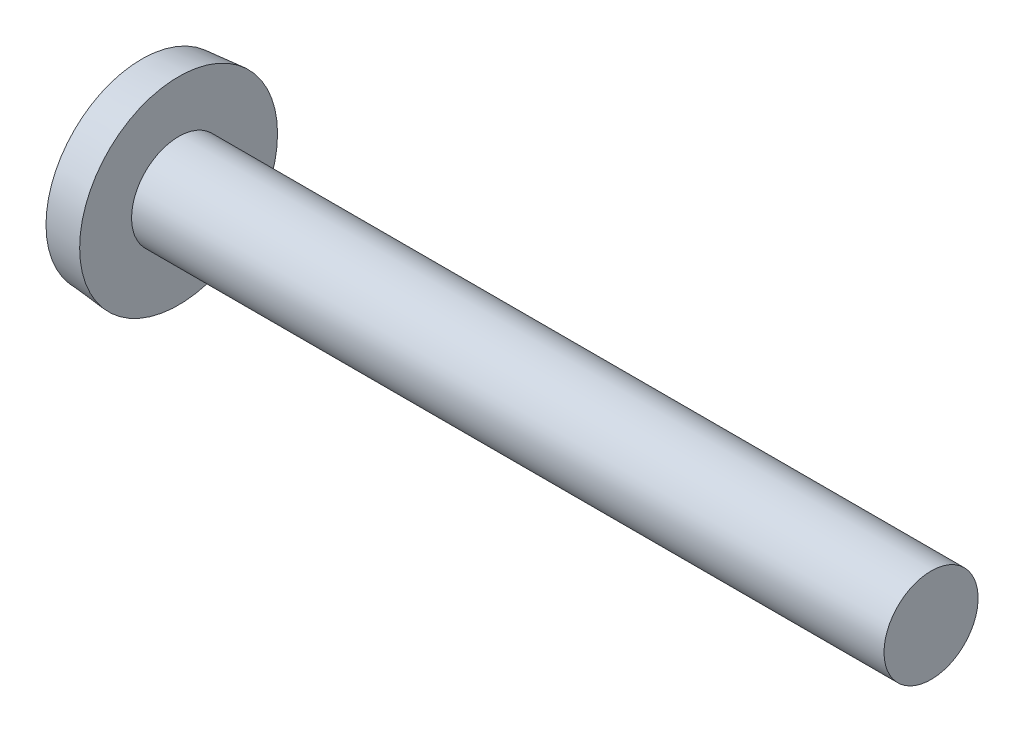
ISO-10303-21;
HEADER;
FILE_DESCRIPTION(('STEP AP214'),'2;1');
FILE_NAME('part.step','',(''),(''),'','','');
FILE_SCHEMA(('AUTOMOTIVE_DESIGN { 1 0 10303 214 1 1 1 1 }'));
ENDSEC;
DATA;
#1=APPLICATION_CONTEXT('core data for automotive mechanical design processes');
#2=APPLICATION_PROTOCOL_DEFINITION('international standard','automotive_design',2000,#1);
#3=PRODUCT_CONTEXT('',#1,'mechanical');
#4=PRODUCT('Part','Part','',(#3));
#5=PRODUCT_RELATED_PRODUCT_CATEGORY('part','',(#4));
#6=PRODUCT_DEFINITION_FORMATION('','',#4);
#7=PRODUCT_DEFINITION_CONTEXT('part definition',#1,'design');
#8=PRODUCT_DEFINITION('design','',#6,#7);
#9=PRODUCT_DEFINITION_SHAPE('','',#8);
#10=(LENGTH_UNIT() NAMED_UNIT(*) SI_UNIT(.MILLI.,.METRE.));
#11=(NAMED_UNIT(*) PLANE_ANGLE_UNIT() SI_UNIT($,.RADIAN.));
#12=(NAMED_UNIT(*) SI_UNIT($,.STERADIAN.) SOLID_ANGLE_UNIT());
#13=UNCERTAINTY_MEASURE_WITH_UNIT(LENGTH_MEASURE(1.E-05),#10,'distance_accuracy_value','');
#14=(GEOMETRIC_REPRESENTATION_CONTEXT(3) GLOBAL_UNCERTAINTY_ASSIGNED_CONTEXT((#13)) GLOBAL_UNIT_ASSIGNED_CONTEXT((#10,
#11,#12)) REPRESENTATION_CONTEXT('',''));
#15=CARTESIAN_POINT('',(0.,0.,0.));
#16=DIRECTION('',(0.,0.,1.));
#17=DIRECTION('',(1.,0.,0.));
#18=AXIS2_PLACEMENT_3D('',#15,#16,#17);
#19=CARTESIAN_POINT('',(7.45540865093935,0.,0.));
#20=DIRECTION('',(-1.,0.,0.));
#21=DIRECTION('',(0.,1.,0.));
#22=AXIS2_PLACEMENT_3D('',#19,#20,#21);
#23=SPHERICAL_SURFACE('',#22,7.45540865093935);
#24=CARTESIAN_POINT('',(0.7366,0.,0.));
#25=DIRECTION('',(-1.,0.,0.));
#26=DIRECTION('',(0.,0.,1.));
#27=AXIS2_PLACEMENT_3D('',#24,#25,#26);
#28=CIRCLE('',#27,3.23121160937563);
#29=CARTESIAN_POINT('',(0.7366,0.,3.23121160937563));
#30=VERTEX_POINT('',#29);
#31=EDGE_CURVE('E150',#30,#30,#28,.T.);
#32=ORIENTED_EDGE('',*,*,#31,.T.);
#33=EDGE_LOOP('',(#32));
#34=FACE_BOUND('',#33,.T.);
#35=CARTESIAN_POINT('',(7.43469231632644,0.,-0.225577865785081));
#36=DIRECTION('',(-0.091451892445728,0.,-0.99580949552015));
#37=DIRECTION('',(-0.99580949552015,0.,0.091451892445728));
#38=AXIS2_PLACEMENT_3D('',#35,#36,#37);
#39=CIRCLE('',#38,7.45196642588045);
#40=CARTESIAN_POINT('',(0.277056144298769,1.96671302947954,0.431756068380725));
#41=VERTEX_POINT('',#40);
#42=CARTESIAN_POINT('',(0.0277773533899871,0.454649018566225,0.454649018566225));
#43=VERTEX_POINT('',#42);
#44=EDGE_CURVE('E121',#41,#43,#39,.F.);
#45=ORIENTED_EDGE('',*,*,#44,.T.);
#46=CARTESIAN_POINT('',(7.43469231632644,-0.225577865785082,0.));
#47=DIRECTION('',(-0.0914518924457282,-0.99580949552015,0.));
#48=DIRECTION('',(0.99580949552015,-0.0914518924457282,0.));
#49=AXIS2_PLACEMENT_3D('',#46,#47,#48);
#50=CIRCLE('',#49,7.45196642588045);
#51=CARTESIAN_POINT('',(0.277056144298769,0.431756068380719,1.96671302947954));
#52=VERTEX_POINT('',#51);
#53=EDGE_CURVE('E102',#43,#52,#50,.F.);
#54=ORIENTED_EDGE('',*,*,#53,.T.);
#55=CARTESIAN_POINT('',(5.67084446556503,0.,-2.27126350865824));
#56=DIRECTION('',(0.617821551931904,0.,0.786318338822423));
#57=DIRECTION('',(0.786318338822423,0.,-0.617821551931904));
#58=AXIS2_PLACEMENT_3D('',#55,#56,#57);
#59=CIRCLE('',#58,6.87312235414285);
#60=CARTESIAN_POINT('',(0.277056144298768,-0.431756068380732,1.96671302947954));
#61=VERTEX_POINT('',#60);
#62=EDGE_CURVE('E113',#61,#52,#59,.F.);
#63=ORIENTED_EDGE('',*,*,#62,.F.);
#64=CARTESIAN_POINT('',(7.43469231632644,0.225577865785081,0.));
#65=DIRECTION('',(-0.091451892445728,0.99580949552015,0.));
#66=DIRECTION('',(-0.99580949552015,-0.091451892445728,0.));
#67=AXIS2_PLACEMENT_3D('',#64,#65,#66);
#68=CIRCLE('',#67,7.45196642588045);
#69=CARTESIAN_POINT('',(0.0277773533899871,-0.454649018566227,0.454649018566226));
#70=VERTEX_POINT('',#69);
#71=EDGE_CURVE('E188',#61,#70,#68,.F.);
#72=ORIENTED_EDGE('',*,*,#71,.T.);
#73=CARTESIAN_POINT('',(0.277056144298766,-1.96671302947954,0.431756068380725));
#74=VERTEX_POINT('',#73);
#75=EDGE_CURVE('E158',#70,#74,#39,.F.);
#76=ORIENTED_EDGE('',*,*,#75,.T.);
#77=CARTESIAN_POINT('',(5.67084446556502,2.27126350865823,0.));
#78=DIRECTION('',(0.617821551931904,-0.786318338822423,0.));
#79=DIRECTION('',(0.786318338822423,0.617821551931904,0.));
#80=AXIS2_PLACEMENT_3D('',#77,#78,#79);
#81=CIRCLE('',#80,6.87312235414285);
#82=CARTESIAN_POINT('',(0.277056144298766,-1.96671302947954,-0.431756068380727));
#83=VERTEX_POINT('',#82);
#84=EDGE_CURVE('E156',#83,#74,#81,.F.);
#85=ORIENTED_EDGE('',*,*,#84,.F.);
#86=CARTESIAN_POINT('',(7.43469231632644,0.,0.225577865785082));
#87=DIRECTION('',(-0.0914518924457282,0.,0.99580949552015));
#88=DIRECTION('',(0.99580949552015,0.,0.0914518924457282));
#89=AXIS2_PLACEMENT_3D('',#86,#87,#88);
#90=CIRCLE('',#89,7.45196642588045);
#91=CARTESIAN_POINT('',(0.0277773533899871,-0.454649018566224,-0.454649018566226));
#92=VERTEX_POINT('',#91);
#93=EDGE_CURVE('E160',#83,#92,#90,.F.);
#94=ORIENTED_EDGE('',*,*,#93,.T.);
#95=CARTESIAN_POINT('',(0.277056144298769,-0.431756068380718,-1.96671302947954));
#96=VERTEX_POINT('',#95);
#97=EDGE_CURVE('E186',#92,#96,#68,.F.);
#98=ORIENTED_EDGE('',*,*,#97,.T.);
#99=CARTESIAN_POINT('',(5.67084446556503,0.,2.27126350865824));
#100=DIRECTION('',(0.617821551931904,0.,-0.786318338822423));
#101=DIRECTION('',(-0.786318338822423,0.,-0.617821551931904));
#102=AXIS2_PLACEMENT_3D('',#99,#100,#101);
#103=CIRCLE('',#102,6.87312235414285);
#104=CARTESIAN_POINT('',(0.277056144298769,0.431756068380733,-1.96671302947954));
#105=VERTEX_POINT('',#104);
#106=EDGE_CURVE('E114',#105,#96,#103,.F.);
#107=ORIENTED_EDGE('',*,*,#106,.F.);
#108=CARTESIAN_POINT('',(0.0277773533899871,0.454649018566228,-0.454649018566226));
#109=VERTEX_POINT('',#108);
#110=EDGE_CURVE('E137',#105,#109,#50,.F.);
#111=ORIENTED_EDGE('',*,*,#110,.T.);
#112=CARTESIAN_POINT('',(0.277056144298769,1.96671302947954,-0.431756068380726));
#113=VERTEX_POINT('',#112);
#114=EDGE_CURVE('E53',#109,#113,#90,.F.);
#115=ORIENTED_EDGE('',*,*,#114,.T.);
#116=CARTESIAN_POINT('',(5.67084446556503,-2.27126350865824,0.));
#117=DIRECTION('',(0.617821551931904,0.786318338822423,0.));
#118=DIRECTION('',(-0.786318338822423,0.617821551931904,0.));
#119=AXIS2_PLACEMENT_3D('',#116,#117,#118);
#120=CIRCLE('',#119,6.87312235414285);
#121=EDGE_CURVE('E38',#41,#113,#120,.F.);
#122=ORIENTED_EDGE('',*,*,#121,.F.);
#123=EDGE_LOOP('',(#45,#54,#63,#72,#76,#85,#94,#98,#107,#111,#115,#122));
#124=FACE_BOUND('',#123,.T.);
#125=ADVANCED_FACE('F30',(#34,#124),#23,.T.);
#126=CARTESIAN_POINT('',(2.78014545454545,0.,-0.20188051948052));
#127=DIRECTION('',(-0.0914518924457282,0.,0.99580949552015));
#128=DIRECTION('',(0.99580949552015,0.,0.0914518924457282));
#129=AXIS2_PLACEMENT_3D('',#126,#127,#128);
#130=PLANE('',#129);
#131=ORIENTED_EDGE('',*,*,#114,.F.);
#132=DIRECTION('',(0.991671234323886,-0.0910718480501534,0.091071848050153));
#133=VECTOR('',#132,1.);
#134=CARTESIAN_POINT('',(2.79837795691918,0.200206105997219,-0.200206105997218));
#135=LINE('',#134,#133);
#136=CARTESIAN_POINT('',(2.4892,0.228600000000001,-0.228599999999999));
#137=VERTEX_POINT('',#136);
#138=EDGE_CURVE('E139',#109,#137,#135,.T.);
#139=ORIENTED_EDGE('',*,*,#138,.T.);
#140=DIRECTION('',(0.78427611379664,-0.616216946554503,0.0720253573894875));
#141=VECTOR('',#140,1.);
#142=CARTESIAN_POINT('',(0.,2.1844,-0.4572));
#143=LINE('',#142,#141);
#144=EDGE_CURVE('E123',#113,#137,#143,.T.);
#145=ORIENTED_EDGE('',*,*,#144,.F.);
#146=EDGE_LOOP('',(#131,#139,#145));
#147=FACE_BOUND('',#146,.T.);
#148=ADVANCED_FACE('F164',(#147),#130,.T.);
#149=DIRECTION('',(0.784276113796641,0.616216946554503,0.0720253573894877));
#150=VECTOR('',#149,1.);
#151=CARTESIAN_POINT('',(0.,-2.1844,-0.457200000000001));
#152=LINE('',#151,#150);
#153=CARTESIAN_POINT('',(2.4892,-0.2286,-0.2286));
#154=VERTEX_POINT('',#153);
#155=EDGE_CURVE('E45',#83,#154,#152,.T.);
#156=ORIENTED_EDGE('',*,*,#155,.T.);
#157=DIRECTION('',(-0.991671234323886,-0.0910718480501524,-0.091071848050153));
#158=VECTOR('',#157,1.);
#159=CARTESIAN_POINT('',(2.79837795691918,-0.200206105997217,-0.200206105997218));
#160=LINE('',#159,#158);
#161=EDGE_CURVE('E184',#154,#92,#160,.T.);
#162=ORIENTED_EDGE('',*,*,#161,.T.);
#163=ORIENTED_EDGE('',*,*,#93,.F.);
#164=EDGE_LOOP('',(#156,#162,#163));
#165=FACE_BOUND('',#164,.T.);
#166=ADVANCED_FACE('F190',(#165),#130,.T.);
#167=CARTESIAN_POINT('',(2.78014545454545,0.,0.201880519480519));
#168=DIRECTION('',(-0.091451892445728,0.,-0.99580949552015));
#169=DIRECTION('',(-0.99580949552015,0.,0.091451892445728));
#170=AXIS2_PLACEMENT_3D('',#167,#168,#169);
#171=PLANE('',#170);
#172=DIRECTION('',(0.78427611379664,-0.616216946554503,-0.0720253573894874));
#173=VECTOR('',#172,1.);
#174=CARTESIAN_POINT('',(0.,2.1844,0.4572));
#175=LINE('',#174,#173);
#176=CARTESIAN_POINT('',(2.4892,0.228599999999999,0.228600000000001));
#177=VERTEX_POINT('',#176);
#178=EDGE_CURVE('E118',#41,#177,#175,.T.);
#179=ORIENTED_EDGE('',*,*,#178,.T.);
#180=DIRECTION('',(-0.991671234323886,0.0910718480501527,0.0910718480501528));
#181=VECTOR('',#180,1.);
#182=CARTESIAN_POINT('',(2.79837795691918,0.200206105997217,0.200206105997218));
#183=LINE('',#182,#181);
#184=EDGE_CURVE('E11',#177,#43,#183,.T.);
#185=ORIENTED_EDGE('',*,*,#184,.T.);
#186=ORIENTED_EDGE('',*,*,#44,.F.);
#187=EDGE_LOOP('',(#179,#185,#186));
#188=FACE_BOUND('',#187,.T.);
#189=ADVANCED_FACE('F120',(#188),#171,.T.);
#190=ORIENTED_EDGE('',*,*,#75,.F.);
#191=DIRECTION('',(0.991671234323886,0.0910718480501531,-0.0910718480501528));
#192=VECTOR('',#191,1.);
#193=CARTESIAN_POINT('',(2.79837795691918,-0.200206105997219,0.200206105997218));
#194=LINE('',#193,#192);
#195=CARTESIAN_POINT('',(2.4892,-0.2286,0.2286));
#196=VERTEX_POINT('',#195);
#197=EDGE_CURVE('E198',#70,#196,#194,.T.);
#198=ORIENTED_EDGE('',*,*,#197,.T.);
#199=DIRECTION('',(0.784276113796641,0.616216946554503,-0.0720253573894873));
#200=VECTOR('',#199,1.);
#201=CARTESIAN_POINT('',(0.,-2.1844,0.4572));
#202=LINE('',#201,#200);
#203=EDGE_CURVE('E169',#74,#196,#202,.T.);
#204=ORIENTED_EDGE('',*,*,#203,.F.);
#205=EDGE_LOOP('',(#190,#198,#204));
#206=FACE_BOUND('',#205,.T.);
#207=ADVANCED_FACE('F197',(#206),#171,.T.);
#208=CARTESIAN_POINT('',(-25.4,0.,0.));
#209=DIRECTION('',(-1.,0.,0.));
#210=DIRECTION('',(0.,0.,1.));
#211=AXIS2_PLACEMENT_3D('',#208,#209,#210);
#212=CYLINDRICAL_SURFACE('',#211,1.5875);
#213=CARTESIAN_POINT('',(27.3812,0.,0.));
#214=DIRECTION('',(-1.,0.,0.));
#215=DIRECTION('',(0.,0.,1.));
#216=AXIS2_PLACEMENT_3D('',#213,#214,#215);
#217=CIRCLE('',#216,1.5875);
#218=CARTESIAN_POINT('',(27.3812,0.,1.5875));
#219=VERTEX_POINT('',#218);
#220=EDGE_CURVE('E153',#219,#219,#217,.T.);
#221=ORIENTED_EDGE('',*,*,#220,.T.);
#222=EDGE_LOOP('',(#221));
#223=FACE_BOUND('',#222,.T.);
#224=CARTESIAN_POINT('',(1.9812,0.,0.));
#225=DIRECTION('',(-1.,0.,0.));
#226=DIRECTION('',(0.,0.,1.));
#227=AXIS2_PLACEMENT_3D('',#224,#225,#226);
#228=CIRCLE('',#227,1.5875);
#229=CARTESIAN_POINT('',(1.9812,0.,1.5875));
#230=VERTEX_POINT('',#229);
#231=EDGE_CURVE('E144',#230,#230,#228,.T.);
#232=ORIENTED_EDGE('',*,*,#231,.F.);
#233=EDGE_LOOP('',(#232));
#234=FACE_BOUND('',#233,.T.);
#235=ADVANCED_FACE('F32',(#223,#234),#212,.T.);
#236=CARTESIAN_POINT('',(27.3812,1.5875,0.));
#237=DIRECTION('',(1.,0.,0.));
#238=DIRECTION('',(0.,0.,-1.));
#239=AXIS2_PLACEMENT_3D('',#236,#237,#238);
#240=PLANE('',#239);
#241=ORIENTED_EDGE('',*,*,#220,.F.);
#242=EDGE_LOOP('',(#241));
#243=FACE_BOUND('',#242,.T.);
#244=ADVANCED_FACE('F229',(#243),#240,.T.);
#245=CARTESIAN_POINT('',(1.9812,0.,0.));
#246=DIRECTION('',(1.,0.,0.));
#247=DIRECTION('',(0.,0.,-1.));
#248=AXIS2_PLACEMENT_3D('',#245,#246,#247);
#249=CONICAL_SURFACE('',#248,3.3401,0.0872664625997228);
#250=ORIENTED_EDGE('',*,*,#31,.F.);
#251=EDGE_LOOP('',(#250));
#252=FACE_BOUND('',#251,.T.);
#253=CARTESIAN_POINT('',(1.9812,0.,0.));
#254=DIRECTION('',(-1.,0.,0.));
#255=DIRECTION('',(0.,0.,1.));
#256=AXIS2_PLACEMENT_3D('',#253,#254,#255);
#257=CIRCLE('',#256,3.3401);
#258=CARTESIAN_POINT('',(1.9812,0.,3.3401));
#259=VERTEX_POINT('',#258);
#260=EDGE_CURVE('E147',#259,#259,#257,.T.);
#261=ORIENTED_EDGE('',*,*,#260,.T.);
#262=EDGE_LOOP('',(#261));
#263=FACE_BOUND('',#262,.T.);
#264=ADVANCED_FACE('F227',(#252,#263),#249,.T.);
#265=CARTESIAN_POINT('',(1.9812,1.5875,0.));
#266=DIRECTION('',(-1.,0.,0.));
#267=DIRECTION('',(0.,0.,1.));
#268=AXIS2_PLACEMENT_3D('',#265,#266,#267);
#269=PLANE('',#268);
#270=ORIENTED_EDGE('',*,*,#260,.F.);
#271=EDGE_LOOP('',(#270));
#272=FACE_BOUND('',#271,.T.);
#273=ORIENTED_EDGE('',*,*,#231,.T.);
#274=EDGE_LOOP('',(#273));
#275=FACE_BOUND('',#274,.T.);
#276=ADVANCED_FACE('F236',(#272,#275),#269,.F.);
#277=CARTESIAN_POINT('',(2.4892,-0.2286,0.2286));
#278=DIRECTION('',(1.,0.,0.));
#279=DIRECTION('',(0.,0.,-1.));
#280=AXIS2_PLACEMENT_3D('',#277,#278,#279);
#281=PLANE('',#280);
#282=DIRECTION('',(0.,1.,0.));
#283=VECTOR('',#282,1.);
#284=CARTESIAN_POINT('',(2.4892,-0.2286,0.2286));
#285=LINE('',#284,#283);
#286=EDGE_CURVE('E110',#196,#177,#285,.T.);
#287=ORIENTED_EDGE('',*,*,#286,.T.);
#288=DIRECTION('',(0.,0.,-1.));
#289=VECTOR('',#288,1.);
#290=CARTESIAN_POINT('',(2.4892,0.2286,0.2286));
#291=LINE('',#290,#289);
#292=EDGE_CURVE('E127',#177,#137,#291,.T.);
#293=ORIENTED_EDGE('',*,*,#292,.T.);
#294=DIRECTION('',(0.,-1.,0.));
#295=VECTOR('',#294,1.);
#296=CARTESIAN_POINT('',(2.4892,0.2286,-0.2286));
#297=LINE('',#296,#295);
#298=EDGE_CURVE('E132',#137,#154,#297,.T.);
#299=ORIENTED_EDGE('',*,*,#298,.T.);
#300=DIRECTION('',(0.,0.,1.));
#301=VECTOR('',#300,1.);
#302=CARTESIAN_POINT('',(2.4892,-0.2286,-0.2286));
#303=LINE('',#302,#301);
#304=EDGE_CURVE('E136',#154,#196,#303,.T.);
#305=ORIENTED_EDGE('',*,*,#304,.T.);
#306=EDGE_LOOP('',(#287,#293,#299,#305));
#307=FACE_BOUND('',#306,.T.);
#308=ADVANCED_FACE('F135',(#307),#281,.F.);
#309=CARTESIAN_POINT('',(2.4892,0.2286,0.2286));
#310=DIRECTION('',(0.617821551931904,0.786318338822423,0.));
#311=DIRECTION('',(-0.786318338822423,0.617821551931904,0.));
#312=AXIS2_PLACEMENT_3D('',#309,#310,#311);
#313=PLANE('',#312);
#314=ORIENTED_EDGE('',*,*,#121,.T.);
#315=ORIENTED_EDGE('',*,*,#144,.T.);
#316=ORIENTED_EDGE('',*,*,#292,.F.);
#317=ORIENTED_EDGE('',*,*,#178,.F.);
#318=EDGE_LOOP('',(#314,#315,#316,#317));
#319=FACE_BOUND('',#318,.T.);
#320=ADVANCED_FACE('F128',(#319),#313,.F.);
#321=CARTESIAN_POINT('',(2.4892,-0.2286,-0.2286));
#322=DIRECTION('',(0.617821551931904,-0.786318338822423,0.));
#323=DIRECTION('',(0.786318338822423,0.617821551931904,0.));
#324=AXIS2_PLACEMENT_3D('',#321,#322,#323);
#325=PLANE('',#324);
#326=ORIENTED_EDGE('',*,*,#84,.T.);
#327=ORIENTED_EDGE('',*,*,#203,.T.);
#328=ORIENTED_EDGE('',*,*,#304,.F.);
#329=ORIENTED_EDGE('',*,*,#155,.F.);
#330=EDGE_LOOP('',(#326,#327,#328,#329));
#331=FACE_BOUND('',#330,.T.);
#332=ADVANCED_FACE('F192',(#331),#325,.F.);
#333=CARTESIAN_POINT('',(2.78014545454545,0.20188051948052,0.));
#334=DIRECTION('',(-0.0914518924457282,-0.99580949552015,0.));
#335=DIRECTION('',(0.99580949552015,-0.0914518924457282,0.));
#336=AXIS2_PLACEMENT_3D('',#333,#334,#335);
#337=PLANE('',#336);
#338=ORIENTED_EDGE('',*,*,#184,.F.);
#339=DIRECTION('',(0.78427611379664,-0.0720253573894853,-0.616216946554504));
#340=VECTOR('',#339,1.);
#341=CARTESIAN_POINT('',(0.,0.457199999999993,2.1844));
#342=LINE('',#341,#340);
#343=EDGE_CURVE('E100',#52,#177,#342,.T.);
#344=ORIENTED_EDGE('',*,*,#343,.F.);
#345=ORIENTED_EDGE('',*,*,#53,.F.);
#346=EDGE_LOOP('',(#338,#344,#345));
#347=FACE_BOUND('',#346,.T.);
#348=ADVANCED_FACE('F99',(#347),#337,.T.);
#349=CARTESIAN_POINT('',(2.78014545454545,-0.201880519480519,0.));
#350=DIRECTION('',(-0.091451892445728,0.99580949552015,0.));
#351=DIRECTION('',(-0.99580949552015,-0.091451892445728,0.));
#352=AXIS2_PLACEMENT_3D('',#349,#350,#351);
#353=PLANE('',#352);
#354=DIRECTION('',(0.78427611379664,0.0720253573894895,-0.616216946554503));
#355=VECTOR('',#354,1.);
#356=CARTESIAN_POINT('',(0.,-0.457200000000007,2.1844));
#357=LINE('',#356,#355);
#358=EDGE_CURVE('E115',#61,#196,#357,.T.);
#359=ORIENTED_EDGE('',*,*,#358,.T.);
#360=ORIENTED_EDGE('',*,*,#197,.F.);
#361=ORIENTED_EDGE('',*,*,#71,.F.);
#362=EDGE_LOOP('',(#359,#360,#361));
#363=FACE_BOUND('',#362,.T.);
#364=ADVANCED_FACE('F205',(#363),#353,.T.);
#365=CARTESIAN_POINT('',(2.4892,-0.228600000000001,0.228599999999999));
#366=DIRECTION('',(0.617821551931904,0.,0.786318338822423));
#367=DIRECTION('',(-0.786318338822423,0.,0.617821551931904));
#368=AXIS2_PLACEMENT_3D('',#365,#366,#367);
#369=PLANE('',#368);
#370=ORIENTED_EDGE('',*,*,#62,.T.);
#371=ORIENTED_EDGE('',*,*,#343,.T.);
#372=ORIENTED_EDGE('',*,*,#286,.F.);
#373=ORIENTED_EDGE('',*,*,#358,.F.);
#374=EDGE_LOOP('',(#370,#371,#372,#373));
#375=FACE_BOUND('',#374,.T.);
#376=ADVANCED_FACE('F107',(#375),#369,.F.);
#377=DIRECTION('',(0.784276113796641,-0.0720253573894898,0.616216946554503));
#378=VECTOR('',#377,1.);
#379=CARTESIAN_POINT('',(0.,0.457200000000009,-2.1844));
#380=LINE('',#379,#378);
#381=EDGE_CURVE('E175',#105,#137,#380,.T.);
#382=ORIENTED_EDGE('',*,*,#381,.T.);
#383=ORIENTED_EDGE('',*,*,#138,.F.);
#384=ORIENTED_EDGE('',*,*,#110,.F.);
#385=EDGE_LOOP('',(#382,#383,#384));
#386=FACE_BOUND('',#385,.T.);
#387=ADVANCED_FACE('F209',(#386),#337,.T.);
#388=ORIENTED_EDGE('',*,*,#161,.F.);
#389=DIRECTION('',(0.784276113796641,0.0720253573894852,0.616216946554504));
#390=VECTOR('',#389,1.);
#391=CARTESIAN_POINT('',(0.,-0.457199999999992,-2.1844));
#392=LINE('',#391,#390);
#393=EDGE_CURVE('E178',#96,#154,#392,.T.);
#394=ORIENTED_EDGE('',*,*,#393,.F.);
#395=ORIENTED_EDGE('',*,*,#97,.F.);
#396=EDGE_LOOP('',(#388,#394,#395));
#397=FACE_BOUND('',#396,.T.);
#398=ADVANCED_FACE('F185',(#397),#353,.T.);
#399=CARTESIAN_POINT('',(2.4892,0.228600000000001,-0.228599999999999));
#400=DIRECTION('',(0.617821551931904,0.,-0.786318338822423));
#401=DIRECTION('',(0.786318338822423,0.,0.617821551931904));
#402=AXIS2_PLACEMENT_3D('',#399,#400,#401);
#403=PLANE('',#402);
#404=ORIENTED_EDGE('',*,*,#106,.T.);
#405=ORIENTED_EDGE('',*,*,#393,.T.);
#406=ORIENTED_EDGE('',*,*,#298,.F.);
#407=ORIENTED_EDGE('',*,*,#381,.F.);
#408=EDGE_LOOP('',(#404,#405,#406,#407));
#409=FACE_BOUND('',#408,.T.);
#410=ADVANCED_FACE('F174',(#409),#403,.F.);
#411=CLOSED_SHELL('',(#125,#148,#166,#189,#207,#235,#244,#264,#276,#308,#320,#332,#348,#364,
#376,#387,#398,#410));
#412=MANIFOLD_SOLID_BREP('B2',#411);
#413=ADVANCED_BREP_SHAPE_REPRESENTATION('',(#18,#412),#14);
#414=SHAPE_DEFINITION_REPRESENTATION(#9,#413);
ENDSEC;
END-ISO-10303-21;
